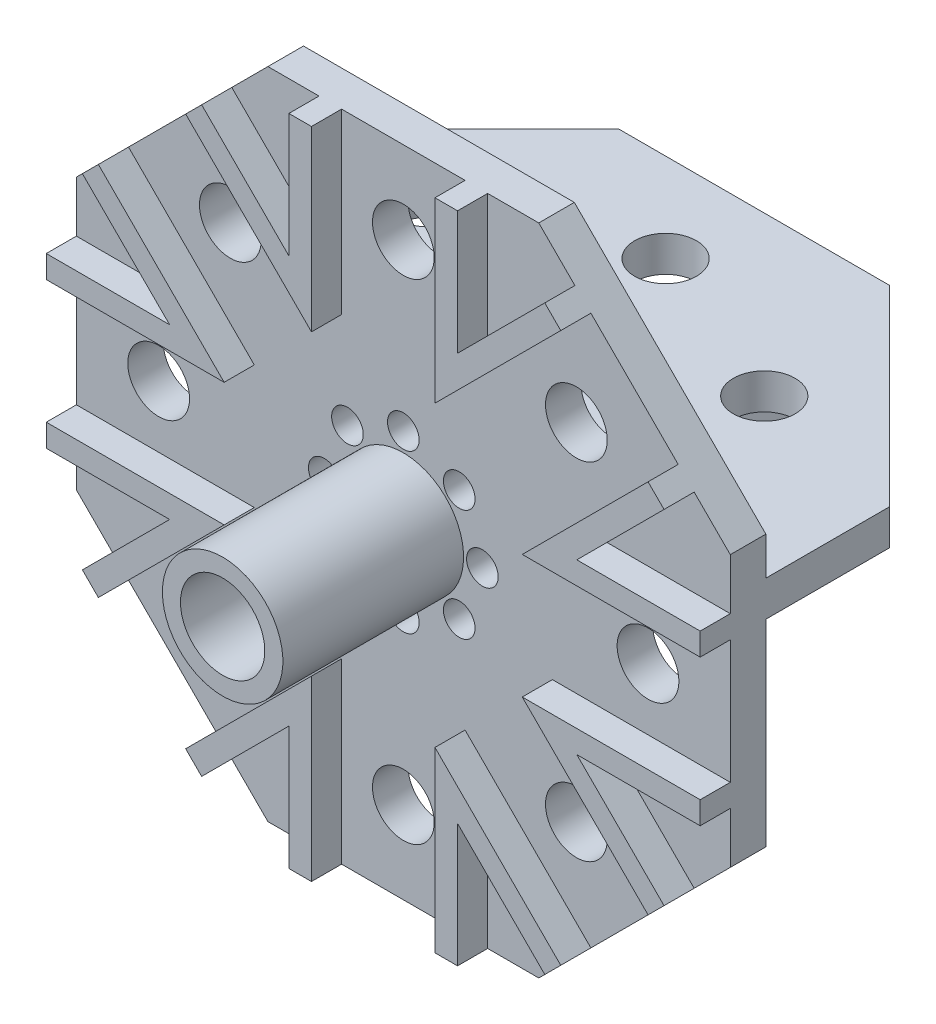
from build123d import *

# Parameters (mm, degrees)
BOSS_EXTRUDE1_DEPTH = 3
SKETCH2_R           = 5.08
SKETCH2_R_2         = 3.556
BOSS_EXTRUDE2_DEPTH = 15.24
SKETCH3_R           = 1.3335
CUT_EXTRUDE1_DEPTH  = 2.2
SKETCH4_R           = 2.6035
CUT_EXTRUDE2_DEPTH  = 16.637
BOSS_EXTRUDE3_DEPTH = 2.54
SKETCH6_W           = 55.15
SKETCH6_H           = 3
BOSS_EXTRUDE4_DEPTH = 26.6
CUT_EXTRUDE3_DEPTH  = 51.424202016
SKETCH8_R           = 2.6035
CUT_EXTRUDE4_DEPTH  = 51.424202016
BOSS_EXTRUDE5_DEPTH = 2.54
BOSS_EXTRUDE6_DEPTH = 3
SKETCH4_2_R         = 2.6035
CUT_EXTRUDE5_DEPTH  = 57.18987342
SKETCH13_R          = 1.275
CUT_EXTRUDE6_DEPTH  = 2.5


with BuildPart() as part:
    # Sketch1 → Boss-Extrude1 (new body)
    with BuildSketch(Plane.XY):
        Polygon((-27.575, 0), (27.575, 0), (27.575, 22.843877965), (11.421938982, 38.996938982), (-11.421938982, 38.996938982), (-27.575, 22.843877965), align=None)
    extrude(amount=BOSS_EXTRUDE1_DEPTH)

    # Sketch2 → Boss-Extrude2 (add)
    with BuildSketch(Plane.XY.offset(3)):
        with Locations(Location((0, 11.421938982, 0), (0, 0, 180))):
            Circle(SKETCH2_R)
        with Locations(Location((0, 11.421938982, 0), (0, 0, 180))):
            Circle(SKETCH2_R_2, mode=Mode.SUBTRACT)
    extrude(amount=BOSS_EXTRUDE2_DEPTH)

    # Sketch3 → Cut-Extrude1 (cut)
    with BuildSketch(Plane.XY.offset(3)):
        with Locations((6.666427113, 11.421938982)):
            Circle(SKETCH3_R)
        with Locations((4.713875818, 6.708063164)):
            Circle(SKETCH3_R)
        with Locations((0, 4.755511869)):
            Circle(SKETCH3_R)
        with Locations((-4.713875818, 6.708063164)):
            Circle(SKETCH3_R)
        with Locations((-6.666427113, 11.421938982)):
            Circle(SKETCH3_R)
        with Locations((-4.713875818, 16.1358148)):
            Circle(SKETCH3_R)
        with Locations((0, 18.088366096)):
            Circle(SKETCH3_R)
        with Locations((4.713875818, 16.1358148)):
            Circle(SKETCH3_R)
    extrude(amount=-CUT_EXTRUDE1_DEPTH, mode=Mode.SUBTRACT)

    # Sketch4 → Cut-Extrude2 (cut)
    with BuildSketch(Plane.XY.offset(3)):
        with Locations((20.636427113, 11.421938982)):
            Circle(SKETCH4_R)
        with Locations((14.592157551, -3.170218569)):
            Circle(SKETCH4_R)
        with Locations((0, -9.214488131)):
            Circle(SKETCH4_R)
        with Locations((-14.592157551, -3.170218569)):
            Circle(SKETCH4_R)
        with Locations((-20.636427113, 11.421938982)):
            Circle(SKETCH4_R)
        with Locations((-14.592157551, 26.014096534)):
            Circle(SKETCH4_R)
        with Locations((0, 32.058366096)):
            Circle(SKETCH4_R)
        with Locations((14.592157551, 26.014096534)):
            Circle(SKETCH4_R)
    extrude(amount=-CUT_EXTRUDE2_DEPTH, mode=Mode.SUBTRACT)

    # Sketch5 → Boss-Extrude3 (add)
    with BuildSketch(Plane.XY.offset(3)):
        Polygon((5.207, 38.996938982), (5.207, 23.992749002), (15.816564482, 34.602313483), (14.469526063, 35.949351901), (7.112, 28.591825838), (7.112, 38.996938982), align=None)
        Polygon((23.180374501, 27.238503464), (12.570810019, 16.628938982), (27.575, 16.628938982), (27.575, 18.533938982), (17.169886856, 18.533938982), (24.527412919, 25.891465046), align=None)
        Polygon((27.575, 6.214938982), (12.570810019, 6.214938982), (23.180374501, -4.394625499), (24.527412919, -3.047587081), (17.169886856, 4.309938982), (27.575, 4.309938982), align=None)
        Polygon((15.816564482, -11.758435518), (5.207, -1.148871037), (5.207, -16.153061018), (7.112, -16.153061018), (7.112, -5.747947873), (14.469526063, -13.105473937), align=None)
        Polygon((-5.207, -16.153061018), (-5.207, -1.148871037), (-15.816564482, -11.758435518), (-14.469526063, -13.105473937), (-7.112, -5.747947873), (-7.112, -16.153061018), align=None)
        Polygon((-23.180374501, -4.394625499), (-12.570810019, 6.214938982), (-27.575, 6.214938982), (-27.575, 4.309938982), (-17.169886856, 4.309938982), (-24.527412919, -3.047587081), align=None)
        Polygon((-27.575, 16.628938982), (-12.570810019, 16.628938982), (-23.180374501, 27.238503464), (-24.527412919, 25.891465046), (-17.169886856, 18.533938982), (-27.575, 18.533938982), align=None)
        Polygon((-15.816564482, 34.602313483), (-5.207, 23.992749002), (-5.207, 38.996938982), (-7.112, 38.996938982), (-7.112, 28.591825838), (-14.469526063, 35.949351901), align=None)
    extrude(amount=BOSS_EXTRUDE3_DEPTH)


with BuildPart() as boss_extrude3_piece_1:
    # of the separate pieces the step leaves, piece 1, a body of its own (boss_extrude3_pieces)
    add(part.part.solids().sort_by_distance((-27.575, 0, 0))[0])

    # Sketch6 → Boss-Extrude4 (add)
    with BuildSketch(Plane(origin=(0, 0, 0), x_dir=(-1, 0, 0), z_dir=(0, 0, -1))):
        with Locations((0, 18.128938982)):
            Rectangle(SKETCH6_W, SKETCH6_H)
    extrude(amount=BOSS_EXTRUDE4_DEPTH)

    # Sketch7 → Cut-Extrude3 (cut, through all)
    with BuildSketch(Plane.XZ.offset(-16.628938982)):
        Polygon((-11.421938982, -26.6), (-27.575, -10.446938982), (-27.575, -26.6), align=None)
        Polygon((27.575, -10.446938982), (11.421938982, -26.6), (27.575, -26.6), align=None)
    extrude(amount=-CUT_EXTRUDE3_DEPTH, mode=Mode.SUBTRACT)

    # Sketch8 → Cut-Extrude4 (cut, through all)
    with BuildSketch(Plane.XZ.offset(-16.628938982)):
        with Locations(Location((-14.206721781, -13.231721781, 0), (0, 0, 270))):
            Circle(SKETCH8_R)
        with Locations(Location((0, -19.11633862, 0), (0, 0, 270))):
            Circle(SKETCH8_R)
        with Locations(Location((14.206721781, -13.231721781, 0), (0, 0, 270))):
            Circle(SKETCH8_R)
    extrude(amount=-CUT_EXTRUDE4_DEPTH, mode=Mode.SUBTRACT)

    # Sketch9 → Boss-Extrude5 (add)
    with BuildSketch(Plane.XZ.offset(-16.628938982)):
        Polygon((5.207, -26.6), (5.207, -11.595810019), (15.816564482, -22.205374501), (14.579127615, -23.442811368), (6.957, -15.820683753), (6.957, -26.6), align=None)
        Polygon((-14.579127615, -23.442811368), (-6.957, -15.820683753), (-6.957, -26.6), (-5.207, -26.6), (-5.207, -11.595810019), (-15.816564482, -22.205374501), align=None)
        Polygon((-12.570810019, -4.232), (-13.808246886, -2.994563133), (-16.795683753, -5.982), (-24.417811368, -13.604127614), (-23.180374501, -14.841564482), align=None)
        Polygon((12.570810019, -4.232), (13.808246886, -2.994563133), (16.795683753, -5.982), (24.417811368, -13.604127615), (23.180374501, -14.841564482), align=None)
    extrude(amount=BOSS_EXTRUDE5_DEPTH)

    # Sketch12 → Boss-Extrude6 (add)
    with BuildSketch(Plane.XY.offset(3)):
        Polygon((27.575, 0), (-27.575, 0), (-11.42193898, -16.153061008), (11.42193898, -16.153061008), align=None)
    extrude(amount=-BOSS_EXTRUDE6_DEPTH)

    # Sketch4_2 → Cut-Extrude5 (cut, through all)
    with BuildSketch(Plane.XY.offset(3)):
        with Locations((-14.592157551, -3.170218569)):
            Circle(SKETCH4_2_R)
        with Locations((0, -9.214488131)):
            Circle(SKETCH4_2_R)
        with Locations((14.592157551, -3.170218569)):
            Circle(SKETCH4_2_R)
    extrude(amount=-CUT_EXTRUDE5_DEPTH, mode=Mode.SUBTRACT)

    # Sketch13 → Cut-Extrude6 (cut)
    with BuildSketch(Plane.XZ.offset(-16.628938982)):
        with Locations(Location((0, -5.14633862, 0), (0, 0, 270))):
            Circle(SKETCH13_R)
        with Locations(Location((-4.328440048, -3.353440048, 0), (0, 0, 270))):
            Circle(SKETCH13_R)
        with Locations(Location((4.328440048, -3.353440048, 0), (0, 0, 270))):
            Circle(SKETCH13_R)
    extrude(amount=-CUT_EXTRUDE6_DEPTH, mode=Mode.SUBTRACT)


with BuildPart() as boss_extrude3_piece_2:
    # of the separate pieces the step leaves, piece 2, a body of its own (boss_extrude3_pieces)
    add(part.part.solids().sort_by_distance((15.816564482, -11.758435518, 3))[0])


with BuildPart() as boss_extrude3_piece_3:
    # of the separate pieces the step leaves, piece 3, a body of its own (boss_extrude3_pieces)
    add(part.part.solids().sort_by_distance((-5.207, -16.153061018, 3))[0])


solid = Compound([boss_extrude3_piece_1.part, boss_extrude3_piece_2.part, boss_extrude3_piece_3.part])
